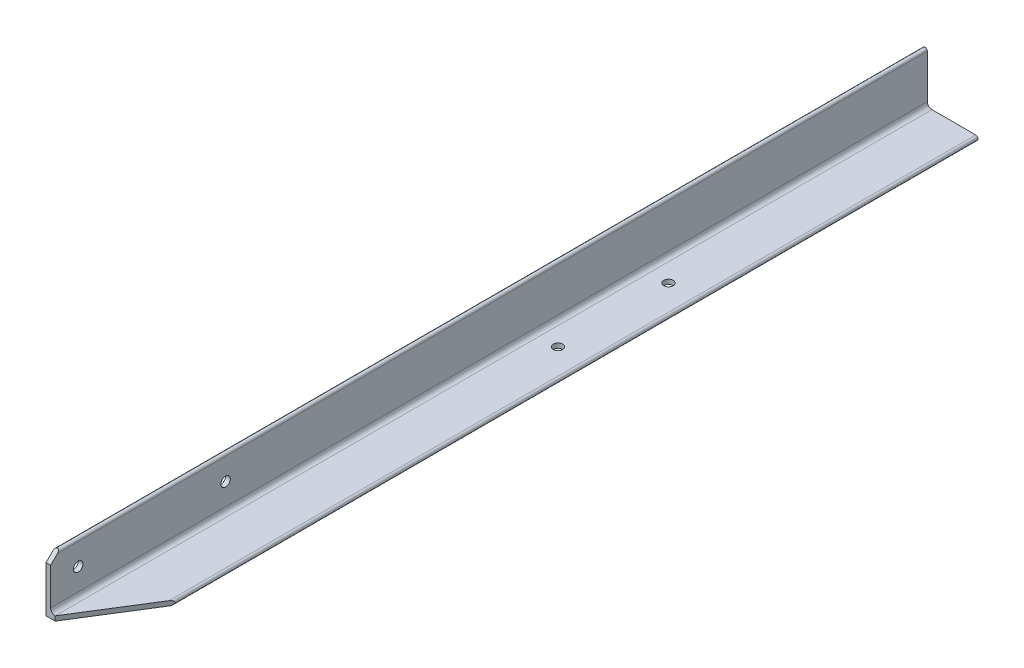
from build123d import *

# Parameters (mm, degrees)
BOSS_EXTRUDE1_DEPTH     = 302.24603
SKETCH2_R               = 3.2385
CUT_EXTRUDE1_DEPTH      = 307.633377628
CUT_EXTRUDE2_DEPTH      = 308.011209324
CUT_EXTRUDE3_DEPTH      = 308.011209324
CUT_EXTRUDE3_DEPTH_BACK = 308.011209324
SKETCH4_R               = 3.2385


with BuildPart() as part:
    # Sketch1 → Boss-Extrude1 (new, symmetric)
    with BuildSketch(Plane.XY):
        with BuildLine():
            Line((0, 0), (0, 36.5125))
            ThreePointArc((0, 36.5125), (1.5875, 38.1), (3.175, 36.5125))
            Line((3.175, 36.5125), (3.175, 6.35))
            ThreePointArc((3.175, 6.35), (4.10493597, 4.10493597), (6.35, 3.175))
            Line((6.35, 3.175), (36.5125, 3.175))
            ThreePointArc((36.5125, 3.175), (38.1, 1.5875), (36.5125, 0))
            Line((36.5125, 0), (0, 0))
        make_face()
    extrude(amount=BOSS_EXTRUDE1_DEPTH, both=True)

    # Sketch2 → Cut-Extrude1 (cut, through all)
    with BuildSketch(Plane(origin=(3.175, 0, 0), x_dir=(0, 0, -1), z_dir=(1, 0, 0))):
        with Locations((-283.19603, 21.43125)):
            Circle(SKETCH2_R)
        with Locations((-181.59603, 21.43125)):
            Circle(SKETCH2_R)
        Polygon((-302.24603, 31.75), (-295.89603, 38.1), (-302.24603, 38.1), align=None)
    extrude(amount=-CUT_EXTRUDE1_DEPTH, mode=Mode.SUBTRACT)

    # Sketch3 → Cut-Extrude2 (cut, through all)
    with BuildSketch(Plane(origin=(0, 0, 0), x_dir=(-1, 0, 0), z_dir=(0, -1, 0))):
        Polygon((-38.1, -302.24603), (-38.1, -251.44603), (-6.35, -302.24603), align=None)
    extrude(amount=-CUT_EXTRUDE2_DEPTH, mode=Mode.SUBTRACT)

    # Sketch4 → Cut-Extrude3 (cut, two sides: drawn at the far end of the back side and taken through both)
    with BuildSketch(Plane.XZ.offset(-CUT_EXTRUDE3_DEPTH_BACK)):
        with Locations((19.05, -31.68853442)):
            Circle(SKETCH4_R)
        with Locations((19.05, -107.88853442)):
            Circle(SKETCH4_R)
    extrude(amount=CUT_EXTRUDE3_DEPTH + CUT_EXTRUDE3_DEPTH_BACK, mode=Mode.SUBTRACT)


solid = part.part
